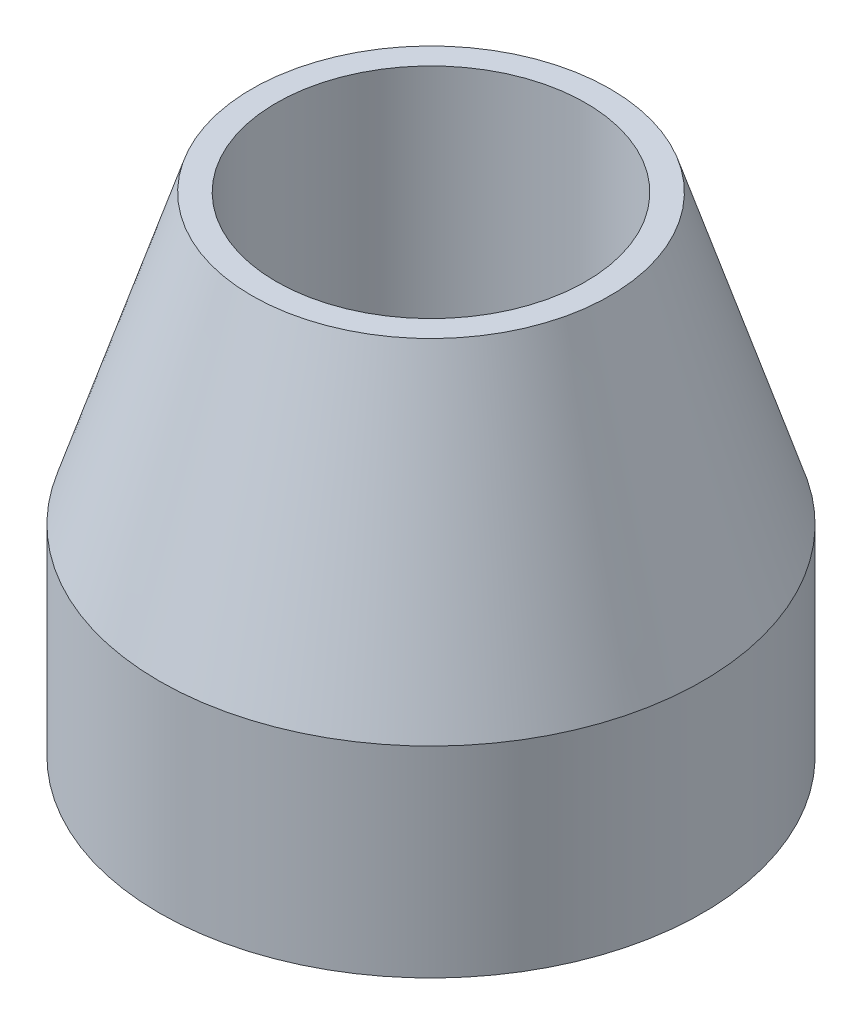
ISO-10303-21;
HEADER;
FILE_DESCRIPTION(('STEP AP214'),'2;1');
FILE_NAME('part.step','',(''),(''),'','','');
FILE_SCHEMA(('AUTOMOTIVE_DESIGN { 1 0 10303 214 1 1 1 1 }'));
ENDSEC;
DATA;
#1=APPLICATION_CONTEXT('core data for automotive mechanical design processes');
#2=APPLICATION_PROTOCOL_DEFINITION('international standard','automotive_design',2000,#1);
#3=PRODUCT_CONTEXT('',#1,'mechanical');
#4=PRODUCT('Part','Part','',(#3));
#5=PRODUCT_RELATED_PRODUCT_CATEGORY('part','',(#4));
#6=PRODUCT_DEFINITION_FORMATION('','',#4);
#7=PRODUCT_DEFINITION_CONTEXT('part definition',#1,'design');
#8=PRODUCT_DEFINITION('design','',#6,#7);
#9=PRODUCT_DEFINITION_SHAPE('','',#8);
#10=(LENGTH_UNIT() NAMED_UNIT(*) SI_UNIT(.MILLI.,.METRE.));
#11=(NAMED_UNIT(*) PLANE_ANGLE_UNIT() SI_UNIT($,.RADIAN.));
#12=(NAMED_UNIT(*) SI_UNIT($,.STERADIAN.) SOLID_ANGLE_UNIT());
#13=UNCERTAINTY_MEASURE_WITH_UNIT(LENGTH_MEASURE(1.E-05),#10,'distance_accuracy_value','');
#14=(GEOMETRIC_REPRESENTATION_CONTEXT(3) GLOBAL_UNCERTAINTY_ASSIGNED_CONTEXT((#13)) GLOBAL_UNIT_ASSIGNED_CONTEXT((#10,
#11,#12)) REPRESENTATION_CONTEXT('',''));
#15=CARTESIAN_POINT('',(0.,0.,0.));
#16=DIRECTION('',(0.,0.,1.));
#17=DIRECTION('',(1.,0.,0.));
#18=AXIS2_PLACEMENT_3D('',#15,#16,#17);
#19=CARTESIAN_POINT('',(518.491618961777,60.4657161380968,0.));
#20=DIRECTION('',(0.,1.,0.));
#21=DIRECTION('',(0.,0.,1.));
#22=AXIS2_PLACEMENT_3D('',#19,#20,#21);
#23=PLANE('',#22);
#24=CARTESIAN_POINT('',(524.84117734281,60.4657161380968,0.));
#25=DIRECTION('',(0.,1.,0.));
#26=DIRECTION('',(0.,0.,1.));
#27=AXIS2_PLACEMENT_3D('',#24,#25,#26);
#28=CIRCLE('',#27,6.34955838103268);
#29=CARTESIAN_POINT('',(524.84117734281,60.4657161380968,6.34955838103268));
#30=VERTEX_POINT('',#29);
#31=EDGE_CURVE('E49',#30,#30,#28,.T.);
#32=ORIENTED_EDGE('',*,*,#31,.T.);
#33=EDGE_LOOP('',(#32));
#34=FACE_BOUND('',#33,.T.);
#35=CARTESIAN_POINT('',(524.84117734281,60.4657161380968,0.));
#36=DIRECTION('',(0.,1.,0.));
#37=DIRECTION('',(0.,0.,1.));
#38=AXIS2_PLACEMENT_3D('',#35,#36,#37);
#39=CIRCLE('',#38,5.48442402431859);
#40=CARTESIAN_POINT('',(524.84117734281,60.4657161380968,5.48442402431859));
#41=VERTEX_POINT('',#40);
#42=EDGE_CURVE('E10',#41,#41,#39,.T.);
#43=ORIENTED_EDGE('',*,*,#42,.F.);
#44=EDGE_LOOP('',(#43));
#45=FACE_BOUND('',#44,.T.);
#46=ADVANCED_FACE('F30',(#34,#45),#23,.T.);
#47=CARTESIAN_POINT('',(524.84117734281,60.4657161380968,0.));
#48=DIRECTION('',(0.,1.,0.));
#49=DIRECTION('',(0.,0.,1.));
#50=AXIS2_PLACEMENT_3D('',#47,#48,#49);
#51=CYLINDRICAL_SURFACE('',#50,5.48442402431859);
#52=ORIENTED_EDGE('',*,*,#42,.T.);
#53=EDGE_LOOP('',(#52));
#54=FACE_BOUND('',#53,.T.);
#55=CARTESIAN_POINT('',(524.84117734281,43.1560920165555,0.));
#56=DIRECTION('',(0.,1.,0.));
#57=DIRECTION('',(0.,0.,1.));
#58=AXIS2_PLACEMENT_3D('',#55,#56,#57);
#59=CIRCLE('',#58,5.48442402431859);
#60=CARTESIAN_POINT('',(524.84117734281,43.1560920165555,5.48442402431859));
#61=VERTEX_POINT('',#60);
#62=EDGE_CURVE('E36',#61,#61,#59,.T.);
#63=ORIENTED_EDGE('',*,*,#62,.F.);
#64=EDGE_LOOP('',(#63));
#65=FACE_BOUND('',#64,.T.);
#66=ADVANCED_FACE('F67',(#54,#65),#51,.F.);
#67=CARTESIAN_POINT('',(515.215732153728,43.1560920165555,0.));
#68=DIRECTION('',(0.,-1.,0.));
#69=DIRECTION('',(0.,0.,-1.));
#70=AXIS2_PLACEMENT_3D('',#67,#68,#69);
#71=PLANE('',#70);
#72=ORIENTED_EDGE('',*,*,#62,.T.);
#73=EDGE_LOOP('',(#72));
#74=FACE_BOUND('',#73,.T.);
#75=CARTESIAN_POINT('',(524.84117734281,43.1560920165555,0.));
#76=DIRECTION('',(0.,1.,0.));
#77=DIRECTION('',(0.,0.,1.));
#78=AXIS2_PLACEMENT_3D('',#75,#76,#77);
#79=CIRCLE('',#78,9.62544518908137);
#80=CARTESIAN_POINT('',(524.84117734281,43.1560920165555,9.62544518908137));
#81=VERTEX_POINT('',#80);
#82=EDGE_CURVE('E40',#81,#81,#79,.T.);
#83=ORIENTED_EDGE('',*,*,#82,.F.);
#84=EDGE_LOOP('',(#83));
#85=FACE_BOUND('',#84,.T.);
#86=ADVANCED_FACE('F63',(#74,#85),#71,.T.);
#87=CARTESIAN_POINT('',(524.84117734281,60.4657161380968,0.));
#88=DIRECTION('',(0.,1.,0.));
#89=DIRECTION('',(0.,0.,1.));
#90=AXIS2_PLACEMENT_3D('',#87,#88,#89);
#91=CYLINDRICAL_SURFACE('',#90,9.62544518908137);
#92=ORIENTED_EDGE('',*,*,#82,.T.);
#93=EDGE_LOOP('',(#92));
#94=FACE_BOUND('',#93,.T.);
#95=CARTESIAN_POINT('',(524.84117734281,50.2740682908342,0.));
#96=DIRECTION('',(0.,1.,0.));
#97=DIRECTION('',(0.,0.,1.));
#98=AXIS2_PLACEMENT_3D('',#95,#96,#97);
#99=CIRCLE('',#98,9.62544518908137);
#100=CARTESIAN_POINT('',(524.84117734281,50.2740682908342,9.62544518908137));
#101=VERTEX_POINT('',#100);
#102=EDGE_CURVE('E44',#101,#101,#99,.T.);
#103=ORIENTED_EDGE('',*,*,#102,.F.);
#104=EDGE_LOOP('',(#103));
#105=FACE_BOUND('',#104,.T.);
#106=ADVANCED_FACE('F57',(#94,#105),#91,.T.);
#107=CARTESIAN_POINT('',(524.84117734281,60.4657161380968,0.));
#108=DIRECTION('',(0.,-1.,0.));
#109=DIRECTION('',(0.,0.,-1.));
#110=AXIS2_PLACEMENT_3D('',#107,#108,#109);
#111=CONICAL_SURFACE('',#110,6.34955838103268,0.31099828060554);
#112=ORIENTED_EDGE('',*,*,#102,.T.);
#113=EDGE_LOOP('',(#112));
#114=FACE_BOUND('',#113,.T.);
#115=ORIENTED_EDGE('',*,*,#31,.F.);
#116=EDGE_LOOP('',(#115));
#117=FACE_BOUND('',#116,.T.);
#118=ADVANCED_FACE('F55',(#114,#117),#111,.T.);
#119=CLOSED_SHELL('',(#46,#66,#86,#106,#118));
#120=MANIFOLD_SOLID_BREP('B2',#119);
#121=ADVANCED_BREP_SHAPE_REPRESENTATION('',(#18,#120),#14);
#122=SHAPE_DEFINITION_REPRESENTATION(#9,#121);
ENDSEC;
END-ISO-10303-21;
